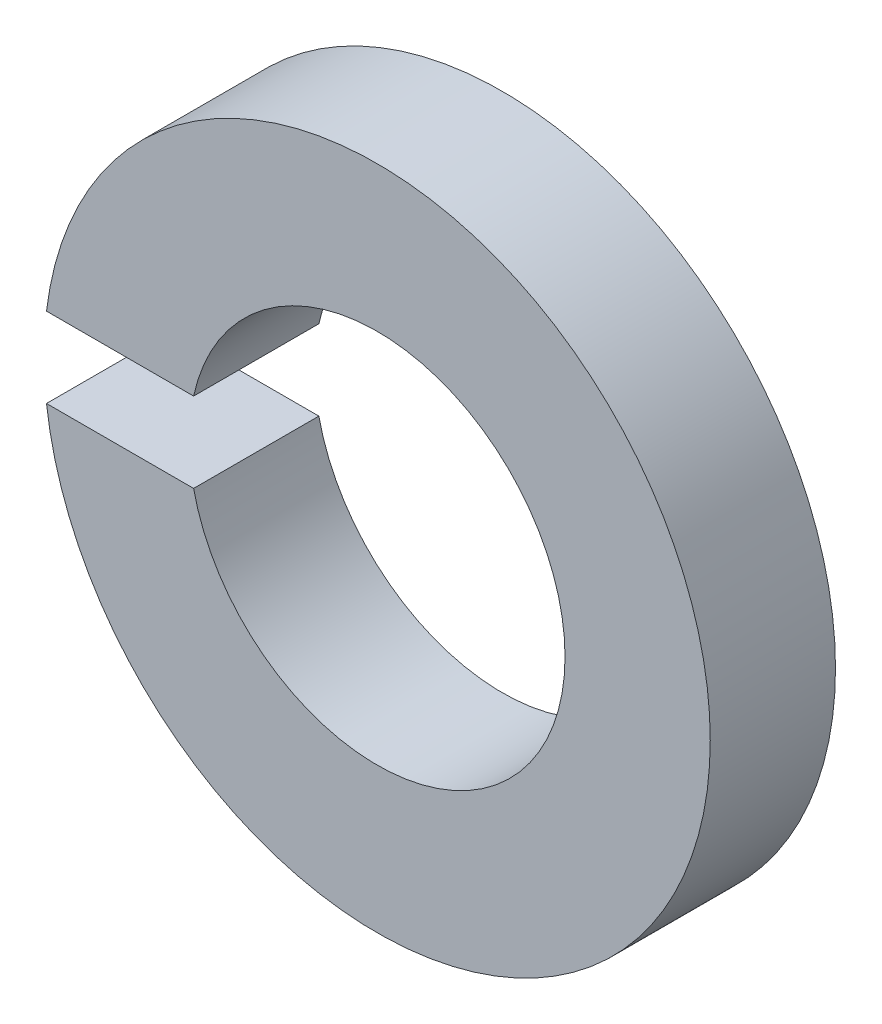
ISO-10303-21;
HEADER;
FILE_DESCRIPTION(('STEP AP214'),'2;1');
FILE_NAME('part.step','',(''),(''),'','','');
FILE_SCHEMA(('AUTOMOTIVE_DESIGN { 1 0 10303 214 1 1 1 1 }'));
ENDSEC;
DATA;
#1=APPLICATION_CONTEXT('core data for automotive mechanical design processes');
#2=APPLICATION_PROTOCOL_DEFINITION('international standard','automotive_design',2000,#1);
#3=PRODUCT_CONTEXT('',#1,'mechanical');
#4=PRODUCT('Part','Part','',(#3));
#5=PRODUCT_RELATED_PRODUCT_CATEGORY('part','',(#4));
#6=PRODUCT_DEFINITION_FORMATION('','',#4);
#7=PRODUCT_DEFINITION_CONTEXT('part definition',#1,'design');
#8=PRODUCT_DEFINITION('design','',#6,#7);
#9=PRODUCT_DEFINITION_SHAPE('','',#8);
#10=(LENGTH_UNIT() NAMED_UNIT(*) SI_UNIT(.MILLI.,.METRE.));
#11=(NAMED_UNIT(*) PLANE_ANGLE_UNIT() SI_UNIT($,.RADIAN.));
#12=(NAMED_UNIT(*) SI_UNIT($,.STERADIAN.) SOLID_ANGLE_UNIT());
#13=UNCERTAINTY_MEASURE_WITH_UNIT(LENGTH_MEASURE(1.E-05),#10,'distance_accuracy_value','');
#14=(GEOMETRIC_REPRESENTATION_CONTEXT(3) GLOBAL_UNCERTAINTY_ASSIGNED_CONTEXT((#13)) GLOBAL_UNIT_ASSIGNED_CONTEXT((#10,
#11,#12)) REPRESENTATION_CONTEXT('',''));
#15=CARTESIAN_POINT('',(0.,0.,0.));
#16=DIRECTION('',(0.,0.,1.));
#17=DIRECTION('',(1.,0.,0.));
#18=AXIS2_PLACEMENT_3D('',#15,#16,#17);
#19=CARTESIAN_POINT('',(0.,0.,1.1938));
#20=DIRECTION('',(0.,0.,-1.));
#21=DIRECTION('',(-1.,0.,0.));
#22=AXIS2_PLACEMENT_3D('',#19,#20,#21);
#23=CYLINDRICAL_SURFACE('',#22,1.7907);
#24=CARTESIAN_POINT('',(0.,0.,0.));
#25=DIRECTION('',(0.,0.,-1.));
#26=DIRECTION('',(1.,0.,0.));
#27=AXIS2_PLACEMENT_3D('',#24,#25,#26);
#28=CIRCLE('',#27,1.7907);
#29=CARTESIAN_POINT('',(-1.74969868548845,0.381,0.));
#30=VERTEX_POINT('',#29);
#31=CARTESIAN_POINT('',(-1.74969868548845,-0.381,0.));
#32=VERTEX_POINT('',#31);
#33=EDGE_CURVE('E98',#30,#32,#28,.T.);
#34=ORIENTED_EDGE('',*,*,#33,.T.);
#35=DIRECTION('',(0.,0.,-1.));
#36=VECTOR('',#35,1.);
#37=CARTESIAN_POINT('',(-1.74969868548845,-0.381,1.1938));
#38=LINE('',#37,#36);
#39=CARTESIAN_POINT('',(-1.74969868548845,-0.381,1.1938));
#40=VERTEX_POINT('',#39);
#41=EDGE_CURVE('E11',#40,#32,#38,.T.);
#42=ORIENTED_EDGE('',*,*,#41,.F.);
#43=CARTESIAN_POINT('',(0.,0.,1.1938));
#44=DIRECTION('',(0.,0.,-1.));
#45=DIRECTION('',(1.,0.,0.));
#46=AXIS2_PLACEMENT_3D('',#43,#44,#45);
#47=CIRCLE('',#46,1.7907);
#48=CARTESIAN_POINT('',(-1.74969868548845,0.381,1.1938));
#49=VERTEX_POINT('',#48);
#50=EDGE_CURVE('E86',#49,#40,#47,.T.);
#51=ORIENTED_EDGE('',*,*,#50,.F.);
#52=DIRECTION('',(0.,0.,-1.));
#53=VECTOR('',#52,1.);
#54=CARTESIAN_POINT('',(-1.74969868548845,0.381,1.1938));
#55=LINE('',#54,#53);
#56=EDGE_CURVE('E94',#49,#30,#55,.T.);
#57=ORIENTED_EDGE('',*,*,#56,.T.);
#58=EDGE_LOOP('',(#34,#42,#51,#57));
#59=FACE_BOUND('',#58,.T.);
#60=ADVANCED_FACE('F35',(#59),#23,.F.);
#61=CARTESIAN_POINT('',(-1.74969868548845,-0.381,1.1938));
#62=DIRECTION('',(0.,-1.,0.));
#63=DIRECTION('',(1.,0.,0.));
#64=AXIS2_PLACEMENT_3D('',#61,#62,#63);
#65=PLANE('',#64);
#66=DIRECTION('',(-1.,0.,0.));
#67=VECTOR('',#66,1.);
#68=CARTESIAN_POINT('',(-1.74969868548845,-0.381,0.));
#69=LINE('',#68,#67);
#70=CARTESIAN_POINT('',(-3.15205710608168,-0.380999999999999,0.));
#71=VERTEX_POINT('',#70);
#72=EDGE_CURVE('E90',#32,#71,#69,.T.);
#73=ORIENTED_EDGE('',*,*,#72,.T.);
#74=DIRECTION('',(0.,0.,-1.));
#75=VECTOR('',#74,1.);
#76=CARTESIAN_POINT('',(-3.15205710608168,-0.380999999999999,1.1938));
#77=LINE('',#76,#75);
#78=CARTESIAN_POINT('',(-3.15205710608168,-0.380999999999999,1.1938));
#79=VERTEX_POINT('',#78);
#80=EDGE_CURVE('E43',#79,#71,#77,.T.);
#81=ORIENTED_EDGE('',*,*,#80,.F.);
#82=DIRECTION('',(-1.,0.,0.));
#83=VECTOR('',#82,1.);
#84=CARTESIAN_POINT('',(-1.74969868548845,-0.381,1.1938));
#85=LINE('',#84,#83);
#86=EDGE_CURVE('E81',#40,#79,#85,.T.);
#87=ORIENTED_EDGE('',*,*,#86,.F.);
#88=ORIENTED_EDGE('',*,*,#41,.T.);
#89=EDGE_LOOP('',(#73,#81,#87,#88));
#90=FACE_BOUND('',#89,.T.);
#91=ADVANCED_FACE('F89',(#90),#65,.F.);
#92=CARTESIAN_POINT('',(0.,0.,1.1938));
#93=DIRECTION('',(0.,0.,-1.));
#94=DIRECTION('',(-1.,0.,0.));
#95=AXIS2_PLACEMENT_3D('',#92,#93,#94);
#96=CYLINDRICAL_SURFACE('',#95,3.175);
#97=CARTESIAN_POINT('',(0.,0.,0.));
#98=DIRECTION('',(0.,0.,1.));
#99=DIRECTION('',(1.,0.,0.));
#100=AXIS2_PLACEMENT_3D('',#97,#98,#99);
#101=CIRCLE('',#100,3.175);
#102=CARTESIAN_POINT('',(-3.15205710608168,0.381,0.));
#103=VERTEX_POINT('',#102);
#104=EDGE_CURVE('E68',#71,#103,#101,.T.);
#105=ORIENTED_EDGE('',*,*,#104,.T.);
#106=DIRECTION('',(0.,0.,-1.));
#107=VECTOR('',#106,1.);
#108=CARTESIAN_POINT('',(-3.15205710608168,0.381,1.1938));
#109=LINE('',#108,#107);
#110=CARTESIAN_POINT('',(-3.15205710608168,0.381,1.1938));
#111=VERTEX_POINT('',#110);
#112=EDGE_CURVE('E91',#111,#103,#109,.T.);
#113=ORIENTED_EDGE('',*,*,#112,.F.);
#114=CARTESIAN_POINT('',(0.,0.,1.1938));
#115=DIRECTION('',(0.,0.,1.));
#116=DIRECTION('',(1.,0.,0.));
#117=AXIS2_PLACEMENT_3D('',#114,#115,#116);
#118=CIRCLE('',#117,3.175);
#119=EDGE_CURVE('E84',#79,#111,#118,.T.);
#120=ORIENTED_EDGE('',*,*,#119,.F.);
#121=ORIENTED_EDGE('',*,*,#80,.T.);
#122=EDGE_LOOP('',(#105,#113,#120,#121));
#123=FACE_BOUND('',#122,.T.);
#124=ADVANCED_FACE('F92',(#123),#96,.T.);
#125=CARTESIAN_POINT('',(-1.74969868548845,0.381,1.1938));
#126=DIRECTION('',(0.,1.,0.));
#127=DIRECTION('',(-1.,0.,0.));
#128=AXIS2_PLACEMENT_3D('',#125,#126,#127);
#129=PLANE('',#128);
#130=DIRECTION('',(1.,0.,0.));
#131=VECTOR('',#130,1.);
#132=CARTESIAN_POINT('',(-1.74969868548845,0.381,0.));
#133=LINE('',#132,#131);
#134=EDGE_CURVE('E74',#103,#30,#133,.T.);
#135=ORIENTED_EDGE('',*,*,#134,.T.);
#136=ORIENTED_EDGE('',*,*,#56,.F.);
#137=DIRECTION('',(1.,0.,0.));
#138=VECTOR('',#137,1.);
#139=CARTESIAN_POINT('',(-1.74969868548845,0.381,1.1938));
#140=LINE('',#139,#138);
#141=EDGE_CURVE('E51',#111,#49,#140,.T.);
#142=ORIENTED_EDGE('',*,*,#141,.F.);
#143=ORIENTED_EDGE('',*,*,#112,.T.);
#144=EDGE_LOOP('',(#135,#136,#142,#143));
#145=FACE_BOUND('',#144,.T.);
#146=ADVANCED_FACE('F105',(#145),#129,.F.);
#147=CARTESIAN_POINT('',(0.,0.,1.1938));
#148=DIRECTION('',(0.,0.,1.));
#149=DIRECTION('',(1.,0.,0.));
#150=AXIS2_PLACEMENT_3D('',#147,#148,#149);
#151=PLANE('',#150);
#152=ORIENTED_EDGE('',*,*,#50,.T.);
#153=ORIENTED_EDGE('',*,*,#86,.T.);
#154=ORIENTED_EDGE('',*,*,#119,.T.);
#155=ORIENTED_EDGE('',*,*,#141,.T.);
#156=EDGE_LOOP('',(#152,#153,#154,#155));
#157=FACE_BOUND('',#156,.T.);
#158=ADVANCED_FACE('F82',(#157),#151,.T.);
#159=CARTESIAN_POINT('',(0.,0.,0.));
#160=DIRECTION('',(0.,0.,1.));
#161=DIRECTION('',(1.,0.,0.));
#162=AXIS2_PLACEMENT_3D('',#159,#160,#161);
#163=PLANE('',#162);
#164=ORIENTED_EDGE('',*,*,#33,.F.);
#165=ORIENTED_EDGE('',*,*,#134,.F.);
#166=ORIENTED_EDGE('',*,*,#104,.F.);
#167=ORIENTED_EDGE('',*,*,#72,.F.);
#168=EDGE_LOOP('',(#164,#165,#166,#167));
#169=FACE_BOUND('',#168,.T.);
#170=ADVANCED_FACE('F108',(#169),#163,.F.);
#171=CLOSED_SHELL('',(#60,#91,#124,#146,#158,#170));
#172=MANIFOLD_SOLID_BREP('B2',#171);
#173=ADVANCED_BREP_SHAPE_REPRESENTATION('',(#18,#172),#14);
#174=SHAPE_DEFINITION_REPRESENTATION(#9,#173);
ENDSEC;
END-ISO-10303-21;
